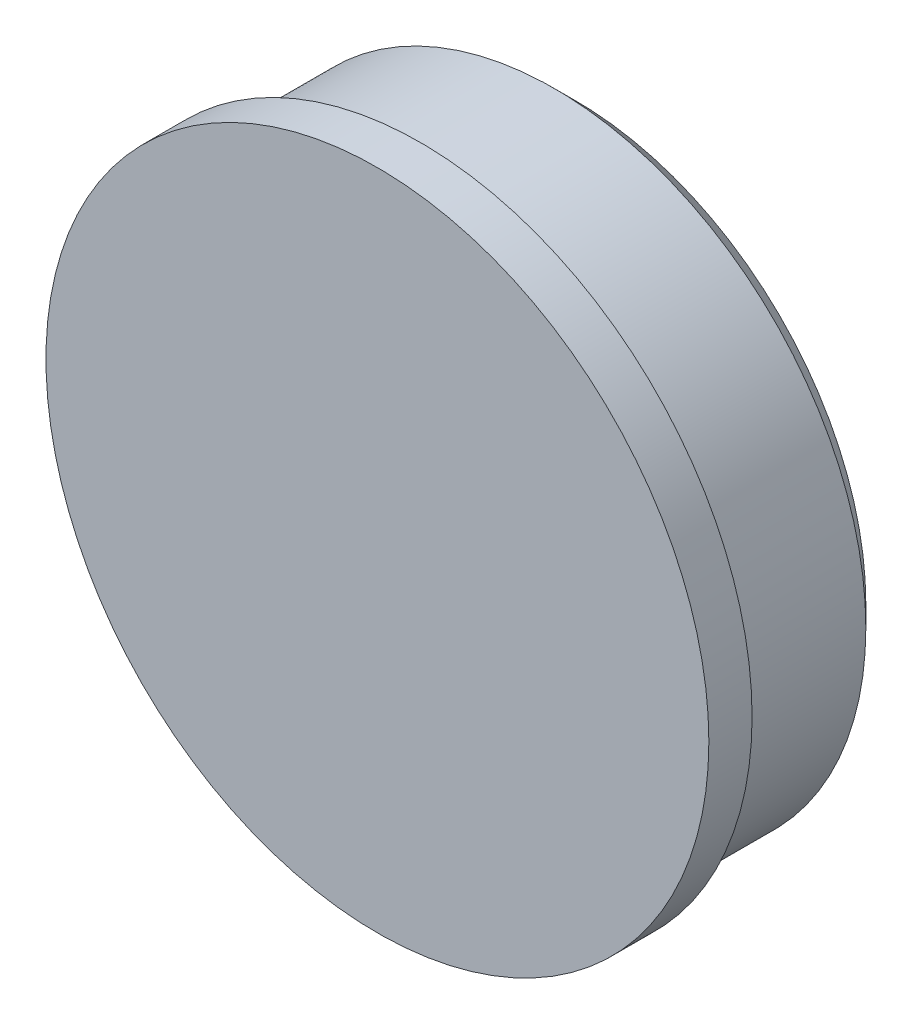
from build123d import *


with BuildPart() as part:
    # Sketch 1 → Revolve 1 (revolve)
    with BuildSketch(Plane(origin=(0, 0, 0), x_dir=(0, 0, -1), z_dir=(1, 0, 0)), mode=Mode.PRIVATE) as revolve_1_sk:
        Polygon((0, 0), (0, 12.6365), (1.647825, 12.6365), (1.647825, 11.8745), (6.746875, 11.8745), (7.540625, 11.08075), (7.540625, 0), align=None)
    revolve(revolve_1_sk.sketch.rotate(Axis((0, 0, 0), (0, 0, -1)), 90), axis=Axis((0, 0, 0), (0, 0, -1)))


solid = part.part
